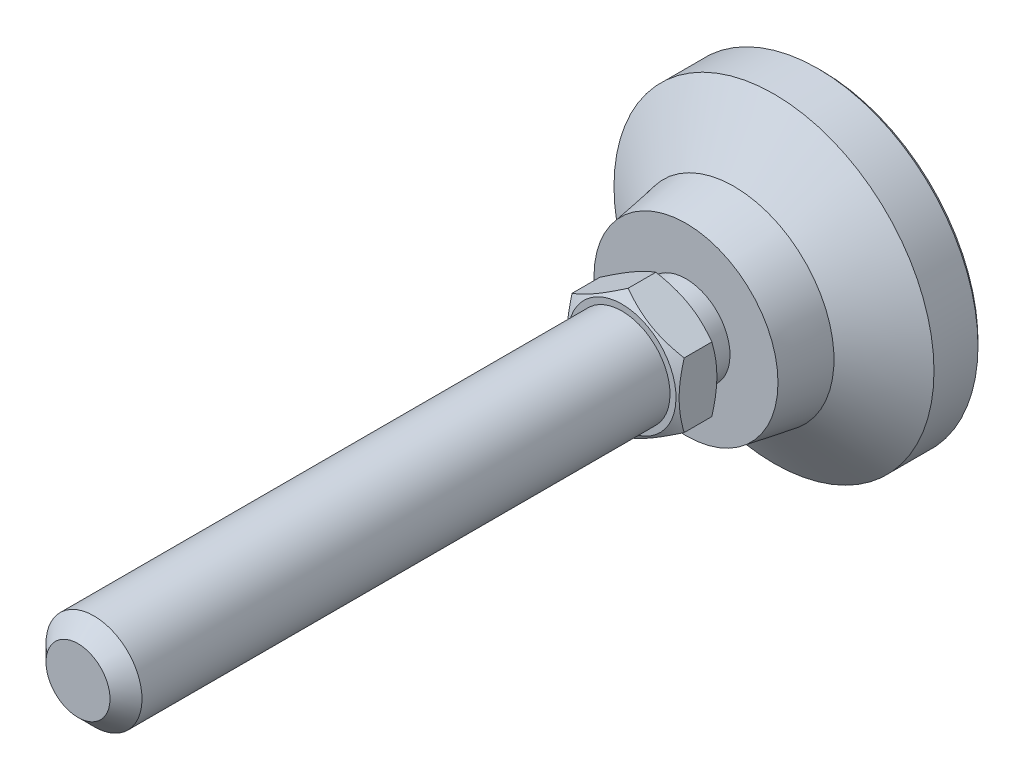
ISO-10303-21;
HEADER;
FILE_DESCRIPTION(('STEP AP214'),'2;1');
FILE_NAME('part.step','',(''),(''),'','','');
FILE_SCHEMA(('AUTOMOTIVE_DESIGN { 1 0 10303 214 1 1 1 1 }'));
ENDSEC;
DATA;
#1=APPLICATION_CONTEXT('core data for automotive mechanical design processes');
#2=APPLICATION_PROTOCOL_DEFINITION('international standard','automotive_design',2000,#1);
#3=PRODUCT_CONTEXT('',#1,'mechanical');
#4=PRODUCT('Part','Part','',(#3));
#5=PRODUCT_RELATED_PRODUCT_CATEGORY('part','',(#4));
#6=PRODUCT_DEFINITION_FORMATION('','',#4);
#7=PRODUCT_DEFINITION_CONTEXT('part definition',#1,'design');
#8=PRODUCT_DEFINITION('design','',#6,#7);
#9=PRODUCT_DEFINITION_SHAPE('','',#8);
#10=(LENGTH_UNIT() NAMED_UNIT(*) SI_UNIT(.MILLI.,.METRE.));
#11=(NAMED_UNIT(*) PLANE_ANGLE_UNIT() SI_UNIT($,.RADIAN.));
#12=(NAMED_UNIT(*) SI_UNIT($,.STERADIAN.) SOLID_ANGLE_UNIT());
#13=UNCERTAINTY_MEASURE_WITH_UNIT(LENGTH_MEASURE(1.E-05),#10,'distance_accuracy_value','');
#14=(GEOMETRIC_REPRESENTATION_CONTEXT(3) GLOBAL_UNCERTAINTY_ASSIGNED_CONTEXT((#13)) GLOBAL_UNIT_ASSIGNED_CONTEXT((#10,
#11,#12)) REPRESENTATION_CONTEXT('',''));
#15=CARTESIAN_POINT('',(0.,0.,0.));
#16=DIRECTION('',(0.,0.,1.));
#17=DIRECTION('',(1.,0.,0.));
#18=AXIS2_PLACEMENT_3D('',#15,#16,#17);
#19=CARTESIAN_POINT('',(-5.49999999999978,0.,20.));
#20=DIRECTION('',(0.,0.,1.));
#21=DIRECTION('',(0.,-1.,0.));
#22=AXIS2_PLACEMENT_3D('',#19,#20,#21);
#23=PLANE('',#22);
#24=CARTESIAN_POINT('',(0.,0.,20.));
#25=DIRECTION('',(0.,0.,-1.));
#26=DIRECTION('',(0.,1.,0.));
#27=AXIS2_PLACEMENT_3D('',#24,#25,#26);
#28=CIRCLE('',#27,5.49999999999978);
#29=CARTESIAN_POINT('',(0.,5.49999999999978,20.));
#30=VERTEX_POINT('',#29);
#31=EDGE_CURVE('E99',#30,#30,#28,.T.);
#32=ORIENTED_EDGE('',*,*,#31,.F.);
#33=EDGE_LOOP('',(#32));
#34=FACE_BOUND('',#33,.T.);
#35=CARTESIAN_POINT('',(0.,0.,20.));
#36=DIRECTION('',(0.,0.,-1.));
#37=DIRECTION('',(0.,1.,0.));
#38=AXIS2_PLACEMENT_3D('',#35,#36,#37);
#39=CIRCLE('',#38,6.75);
#40=CARTESIAN_POINT('',(0.,6.75,20.));
#41=VERTEX_POINT('',#40);
#42=EDGE_CURVE('E79',#41,#41,#39,.T.);
#43=ORIENTED_EDGE('',*,*,#42,.T.);
#44=EDGE_LOOP('',(#43));
#45=FACE_BOUND('',#44,.T.);
#46=ADVANCED_FACE('F14',(#34,#45),#23,.F.);
#47=CARTESIAN_POINT('',(0.,0.,-1.00000000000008));
#48=DIRECTION('',(0.,0.,-1.));
#49=DIRECTION('',(0.,1.,0.));
#50=AXIS2_PLACEMENT_3D('',#47,#48,#49);
#51=CYLINDRICAL_SURFACE('',#50,20.);
#52=CARTESIAN_POINT('',(0.,0.,0.500000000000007));
#53=DIRECTION('',(0.,0.,-1.));
#54=DIRECTION('',(0.,1.,0.));
#55=AXIS2_PLACEMENT_3D('',#52,#53,#54);
#56=CIRCLE('',#55,20.);
#57=CARTESIAN_POINT('',(0.,20.,0.500000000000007));
#58=VERTEX_POINT('',#57);
#59=EDGE_CURVE('E117',#58,#58,#56,.F.);
#60=ORIENTED_EDGE('',*,*,#59,.T.);
#61=EDGE_LOOP('',(#60));
#62=FACE_BOUND('',#61,.T.);
#63=CARTESIAN_POINT('',(0.,0.,6.));
#64=DIRECTION('',(0.,0.,-1.));
#65=DIRECTION('',(0.,1.,0.));
#66=AXIS2_PLACEMENT_3D('',#63,#64,#65);
#67=CIRCLE('',#66,20.);
#68=CARTESIAN_POINT('',(0.,20.,6.));
#69=VERTEX_POINT('',#68);
#70=EDGE_CURVE('E111',#69,#69,#67,.T.);
#71=ORIENTED_EDGE('',*,*,#70,.T.);
#72=EDGE_LOOP('',(#71));
#73=FACE_BOUND('',#72,.T.);
#74=ADVANCED_FACE('F239',(#62,#73),#51,.T.);
#75=CARTESIAN_POINT('',(0.,0.,11.));
#76=DIRECTION('',(0.,0.,-1.));
#77=DIRECTION('',(0.,1.,0.));
#78=AXIS2_PLACEMENT_3D('',#75,#76,#77);
#79=CONICAL_SURFACE('',#78,12.5,0.98279372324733);
#80=ORIENTED_EDGE('',*,*,#70,.F.);
#81=EDGE_LOOP('',(#80));
#82=FACE_BOUND('',#81,.T.);
#83=CARTESIAN_POINT('',(0.,0.,11.));
#84=DIRECTION('',(0.,0.,-1.));
#85=DIRECTION('',(0.,1.,0.));
#86=AXIS2_PLACEMENT_3D('',#83,#84,#85);
#87=CIRCLE('',#86,12.5);
#88=CARTESIAN_POINT('',(0.,12.5,11.));
#89=VERTEX_POINT('',#88);
#90=EDGE_CURVE('E108',#89,#89,#87,.T.);
#91=ORIENTED_EDGE('',*,*,#90,.T.);
#92=EDGE_LOOP('',(#91));
#93=FACE_BOUND('',#92,.T.);
#94=ADVANCED_FACE('F246',(#82,#93),#79,.T.);
#95=CARTESIAN_POINT('',(0.,0.,17.));
#96=DIRECTION('',(0.,0.,-1.));
#97=DIRECTION('',(0.,1.,0.));
#98=AXIS2_PLACEMENT_3D('',#95,#96,#97);
#99=CONICAL_SURFACE('',#98,11.5,0.165148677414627);
#100=ORIENTED_EDGE('',*,*,#90,.F.);
#101=EDGE_LOOP('',(#100));
#102=FACE_BOUND('',#101,.T.);
#103=CARTESIAN_POINT('',(0.,0.,17.));
#104=DIRECTION('',(0.,0.,-1.));
#105=DIRECTION('',(0.,1.,0.));
#106=AXIS2_PLACEMENT_3D('',#103,#104,#105);
#107=CIRCLE('',#106,11.5);
#108=CARTESIAN_POINT('',(0.,11.5,17.));
#109=VERTEX_POINT('',#108);
#110=EDGE_CURVE('E105',#109,#109,#107,.T.);
#111=ORIENTED_EDGE('',*,*,#110,.T.);
#112=EDGE_LOOP('',(#111));
#113=FACE_BOUND('',#112,.T.);
#114=ADVANCED_FACE('F258',(#102,#113),#99,.T.);
#115=CARTESIAN_POINT('',(-11.5,0.,17.));
#116=DIRECTION('',(0.,0.,-1.));
#117=DIRECTION('',(0.,1.,0.));
#118=AXIS2_PLACEMENT_3D('',#115,#116,#117);
#119=PLANE('',#118);
#120=ORIENTED_EDGE('',*,*,#110,.F.);
#121=EDGE_LOOP('',(#120));
#122=FACE_BOUND('',#121,.T.);
#123=CARTESIAN_POINT('',(0.,0.,17.));
#124=DIRECTION('',(0.,0.,-1.));
#125=DIRECTION('',(0.,1.,0.));
#126=AXIS2_PLACEMENT_3D('',#123,#124,#125);
#127=CIRCLE('',#126,5.49999999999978);
#128=CARTESIAN_POINT('',(0.,5.49999999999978,17.));
#129=VERTEX_POINT('',#128);
#130=EDGE_CURVE('E102',#129,#129,#127,.T.);
#131=ORIENTED_EDGE('',*,*,#130,.T.);
#132=EDGE_LOOP('',(#131));
#133=FACE_BOUND('',#132,.T.);
#134=ADVANCED_FACE('F254',(#122,#133),#119,.F.);
#135=CARTESIAN_POINT('',(0.,0.,-1.00000000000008));
#136=DIRECTION('',(0.,0.,-1.));
#137=DIRECTION('',(0.,1.,0.));
#138=AXIS2_PLACEMENT_3D('',#135,#136,#137);
#139=CYLINDRICAL_SURFACE('',#138,5.49999999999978);
#140=ORIENTED_EDGE('',*,*,#130,.F.);
#141=EDGE_LOOP('',(#140));
#142=FACE_BOUND('',#141,.T.);
#143=ORIENTED_EDGE('',*,*,#31,.T.);
#144=EDGE_LOOP('',(#143));
#145=FACE_BOUND('',#144,.T.);
#146=ADVANCED_FACE('F251',(#142,#145),#139,.T.);
#147=CARTESIAN_POINT('',(0.,0.,0.));
#148=DIRECTION('',(0.,0.,-1.));
#149=DIRECTION('',(0.,1.,0.));
#150=AXIS2_PLACEMENT_3D('',#147,#148,#149);
#151=PLANE('',#150);
#152=CARTESIAN_POINT('',(0.,0.,0.));
#153=DIRECTION('',(0.,0.,-1.));
#154=DIRECTION('',(0.,1.,0.));
#155=AXIS2_PLACEMENT_3D('',#152,#153,#154);
#156=CIRCLE('',#155,19.5);
#157=CARTESIAN_POINT('',(0.,19.5,0.));
#158=VERTEX_POINT('',#157);
#159=EDGE_CURVE('E114',#158,#158,#156,.T.);
#160=ORIENTED_EDGE('',*,*,#159,.T.);
#161=EDGE_LOOP('',(#160));
#162=FACE_BOUND('',#161,.T.);
#163=ADVANCED_FACE('F197',(#162),#151,.T.);
#164=CARTESIAN_POINT('',(0.,0.,0.));
#165=DIRECTION('',(0.,0.,1.));
#166=DIRECTION('',(0.,-1.,0.));
#167=AXIS2_PLACEMENT_3D('',#164,#165,#166);
#168=CONICAL_SURFACE('',#167,19.5,0.785398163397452);
#169=ORIENTED_EDGE('',*,*,#59,.F.);
#170=EDGE_LOOP('',(#169));
#171=FACE_BOUND('',#170,.T.);
#172=ORIENTED_EDGE('',*,*,#159,.F.);
#173=EDGE_LOOP('',(#172));
#174=FACE_BOUND('',#173,.T.);
#175=ADVANCED_FACE('F16',(#171,#174),#168,.T.);
#176=CARTESIAN_POINT('',(0.,0.,20.));
#177=DIRECTION('',(0.,0.,1.));
#178=DIRECTION('',(0.,-1.,0.));
#179=AXIS2_PLACEMENT_3D('',#176,#177,#178);
#180=CONICAL_SURFACE('',#179,6.75,1.0471975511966);
#181=CARTESIAN_POINT('',(-7.,10.8488447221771,23.5571335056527));
#182=CARTESIAN_POINT('',(-7.,10.54316649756,23.408880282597));
#183=CARTESIAN_POINT('',(-7.,10.2367858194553,23.2620505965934));
#184=CARTESIAN_POINT('',(-7.,9.62224595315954,22.972039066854));
#185=CARTESIAN_POINT('',(-7.,9.3140864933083,22.828857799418));
#186=CARTESIAN_POINT('',(-7.,8.69402439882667,22.5462220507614));
#187=CARTESIAN_POINT('',(-7.,8.38211051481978,22.4067921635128));
#188=CARTESIAN_POINT('',(-7.,7.75579949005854,22.1336476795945));
#189=CARTESIAN_POINT('',(-7.,7.44140246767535,21.9999328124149));
#190=CARTESIAN_POINT('',(-7.,6.79950510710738,21.7355595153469));
#191=CARTESIAN_POINT('',(-7.,6.47190749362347,21.6051359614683));
#192=CARTESIAN_POINT('',(-7.,5.81287781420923,21.3541766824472));
#193=CARTESIAN_POINT('',(-7.,5.48144532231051,21.2336420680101));
#194=CARTESIAN_POINT('',(-7.,4.81483717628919,21.0056303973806));
#195=CARTESIAN_POINT('',(-7.,4.47967068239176,20.8981268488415));
#196=CARTESIAN_POINT('',(-7.,3.80454198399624,20.6996300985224));
#197=CARTESIAN_POINT('',(-7.,3.46458132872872,20.6086316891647));
#198=CARTESIAN_POINT('',(-7.,2.78149969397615,20.448006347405));
#199=CARTESIAN_POINT('',(-7.,2.43840664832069,20.3782638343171));
#200=CARTESIAN_POINT('',(-7.,1.92064834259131,20.2926149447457));
#201=CARTESIAN_POINT('',(-7.,1.74752969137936,20.2672249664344));
#202=CARTESIAN_POINT('',(-7.,1.40043427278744,20.2232648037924));
#203=CARTESIAN_POINT('',(-7.,1.22645758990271,20.2046939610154));
#204=CARTESIAN_POINT('',(-7.,0.880149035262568,20.1749746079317));
#205=CARTESIAN_POINT('',(-7.,0.707825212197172,20.1637326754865));
#206=CARTESIAN_POINT('',(-7.,0.36285665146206,20.1485455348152));
#207=CARTESIAN_POINT('',(-7.,0.190211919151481,20.1446002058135));
#208=CARTESIAN_POINT('',(-7.,-0.155089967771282,20.1441003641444));
#209=CARTESIAN_POINT('',(-7.,-0.327747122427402,20.147545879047));
#210=CARTESIAN_POINT('',(-7.,-0.672762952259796,20.1617436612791));
#211=CARTESIAN_POINT('',(-7.,-0.845121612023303,20.17249629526));
#212=CARTESIAN_POINT('',(-7.,-1.25956110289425,20.2069092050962));
#213=CARTESIAN_POINT('',(-7.,-1.50135915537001,20.2340480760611));
#214=CARTESIAN_POINT('',(-7.,-1.98314470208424,20.3012244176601));
#215=CARTESIAN_POINT('',(-7.,-2.22313194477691,20.3412636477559));
#216=CARTESIAN_POINT('',(-7.,-2.9401119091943,20.4786074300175));
#217=CARTESIAN_POINT('',(-7.,-3.41385239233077,20.5931126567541));
#218=CARTESIAN_POINT('',(-7.,-4.12221452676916,20.7914787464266));
#219=CARTESIAN_POINT('',(-7.,-4.36051529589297,20.8629554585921));
#220=CARTESIAN_POINT('',(-7.,-4.83480193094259,21.0132839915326));
#221=CARTESIAN_POINT('',(-7.,-5.07078778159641,21.0921358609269));
#222=CARTESIAN_POINT('',(-7.,-5.54051977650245,21.25595358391));
#223=CARTESIAN_POINT('',(-7.,-5.77426664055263,21.340917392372));
#224=CARTESIAN_POINT('',(-7.,-6.23982693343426,21.5159641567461));
#225=CARTESIAN_POINT('',(-7.,-6.47164038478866,21.6060470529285));
#226=CARTESIAN_POINT('',(-7.,-7.0182384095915,21.824296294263));
#227=CARTESIAN_POINT('',(-7.,-7.33228157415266,21.954316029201));
#228=CARTESIAN_POINT('',(-7.,-7.95770289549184,22.2206327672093));
#229=CARTESIAN_POINT('',(-7.,-8.26908088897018,22.3569301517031));
#230=CARTESIAN_POINT('',(-7.,-8.88966173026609,22.634542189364));
#231=CARTESIAN_POINT('',(-7.,-9.19886412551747,22.775857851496));
#232=CARTESIAN_POINT('',(-7.,-9.81540622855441,23.0625028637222));
#233=CARTESIAN_POINT('',(-7.,-10.1227458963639,23.2078322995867));
#234=CARTESIAN_POINT('',(-7.,-10.7361886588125,23.50190577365));
#235=CARTESIAN_POINT('',(-7.,-11.0422900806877,23.6506532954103));
#236=CARTESIAN_POINT('',(-7.,-11.6531748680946,23.9508331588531));
#237=CARTESIAN_POINT('',(-7.,-11.9579582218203,24.1022655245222));
#238=CARTESIAN_POINT('',(-7.,-12.8705649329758,24.5598357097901));
#239=CARTESIAN_POINT('',(-7.,-13.4767270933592,24.8692863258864));
#240=CARTESIAN_POINT('',(-7.,-14.6351492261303,25.4681976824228));
#241=CARTESIAN_POINT('',(-7.,-15.1876682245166,25.7571596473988));
#242=CARTESIAN_POINT('',(-7.,-16.2906541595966,26.3390179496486));
#243=CARTESIAN_POINT('',(-7.,-16.8411210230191,26.6319144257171));
#244=CARTESIAN_POINT('',(-7.,-17.9390847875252,27.2199706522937));
#245=CARTESIAN_POINT('',(-7.,-18.4865856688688,27.5151229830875));
#246=CARTESIAN_POINT('',(-7.,-19.5802752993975,28.107778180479));
#247=CARTESIAN_POINT('',(-7.,-20.126464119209,28.4052809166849));
#248=CARTESIAN_POINT('',(-7.,-20.6721700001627,28.7036609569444));
#249=B_SPLINE_CURVE_WITH_KNOTS('',3,(#181,#182,#183,#184,#185,#186,#187,#188,#189,#190,#191,
#192,#193,#194,#195,#196,#197,#198,#199,#200,#201,#202,#203,#204,#205,#206,#207,#208,#209,#210,
#211,#212,#213,#214,#215,#216,#217,#218,#219,#220,#221,#222,#223,#224,#225,#226,#227,#228,#229,
#230,#231,#232,#233,#234,#235,#236,#237,#238,#239,#240,#241,#242,#243,#244,#245,#246,#247,#248),
.UNSPECIFIED.,.F.,.F.,(4,2,2,2,2,2,2,2,2,2,2,2,2,2,2,2,2,2,2,2,2,2,2,2,2,2,2,2,2,2,2,2,2,4),(0.,
1.01921008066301,2.03858016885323,3.06351163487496,4.08839453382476,5.14608656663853,
6.20389723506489,7.25951994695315,8.31480901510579,9.36425304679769,9.88905173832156,
10.4137997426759,10.9317207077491,11.4496330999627,11.9675474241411,12.4854877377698,
13.2150242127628,13.9446602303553,15.4047436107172,16.151050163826,16.8973616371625,
17.6434245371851,18.389478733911,19.4090700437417,20.4287233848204,21.4485829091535,
22.4684642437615,23.4894356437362,24.510416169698,26.5521035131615,28.4226443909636,
30.2932514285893,32.1592166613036,34.025079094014),.UNSPECIFIED.);
#250=CARTESIAN_POINT('',(-7.,4.04145188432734,20.7695523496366));
#251=VERTEX_POINT('',#250);
#252=CARTESIAN_POINT('',(-7.,-4.04145188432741,20.7695523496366));
#253=VERTEX_POINT('',#252);
#254=EDGE_CURVE('E85',#251,#253,#249,.T.);
#255=ORIENTED_EDGE('',*,*,#254,.F.);
#256=CARTESIAN_POINT('',(0.000200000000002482,8.08301923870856,20.7696190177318));
#257=CARTESIAN_POINT('',(-0.153667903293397,7.99418356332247,20.7183374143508));
#258=CARTESIAN_POINT('',(-0.308109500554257,7.90501666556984,20.669383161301));
#259=CARTESIAN_POINT('',(-0.618246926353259,7.725958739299,20.5767703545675));
#260=CARTESIAN_POINT('',(-0.773943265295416,7.63606741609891,20.5331140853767));
#261=CARTESIAN_POINT('',(-1.24352516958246,7.36495417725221,20.4109491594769));
#262=CARTESIAN_POINT('',(-1.5592643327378,7.18266208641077,20.3414631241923));
#263=CARTESIAN_POINT('',(-2.03176224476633,6.90986528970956,20.2599825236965));
#264=CARTESIAN_POINT('',(-2.18710922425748,6.82017566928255,20.2367710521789));
#265=CARTESIAN_POINT('',(-2.49850511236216,6.64039116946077,20.1978487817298));
#266=CARTESIAN_POINT('',(-2.6545539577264,6.55029632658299,20.1821373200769));
#267=CARTESIAN_POINT('',(-2.96692267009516,6.36995016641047,20.1586154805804));
#268=CARTESIAN_POINT('',(-3.12324202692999,6.27969914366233,20.1507961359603));
#269=CARTESIAN_POINT('',(-3.43601650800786,6.09911871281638,20.1432178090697));
#270=CARTESIAN_POINT('',(-3.59247162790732,6.00878930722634,20.1434585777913));
#271=CARTESIAN_POINT('',(-4.02110687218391,5.76131663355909,20.1551972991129));
#272=CARTESIAN_POINT('',(-4.29314668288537,5.6042543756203,20.1749033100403));
#273=CARTESIAN_POINT('',(-4.83541944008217,5.29117305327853,20.2373910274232));
#274=CARTESIAN_POINT('',(-5.10565047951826,5.13515508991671,20.2801940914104));
#275=CARTESIAN_POINT('',(-5.64901454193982,4.82144370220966,20.3871892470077));
#276=CARTESIAN_POINT('',(-5.92207900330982,4.66378986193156,20.4518346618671));
#277=CARTESIAN_POINT('',(-6.46413578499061,4.35083323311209,20.5985536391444));
#278=CARTESIAN_POINT('',(-6.73313504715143,4.19552643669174,20.6805927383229));
#279=CARTESIAN_POINT('',(-7.0002,4.0413364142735,20.7696190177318));
#280=B_SPLINE_CURVE_WITH_KNOTS('',3,(#256,#257,#258,#259,#260,#261,#262,#263,#264,#265,#266,
#267,#268,#269,#270,#271,#272,#273,#274,#275,#276,#277,#278,#279),.UNSPECIFIED.,.F.,.F.,(4,2,2,
2,2,2,2,2,2,2,2,4),(0.,0.554727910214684,1.10969417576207,2.22193274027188,2.76443041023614,
3.30688013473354,3.84871284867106,4.39052882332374,5.33376515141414,6.27787517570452,
7.24292418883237,8.20607866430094),.UNSPECIFIED.);
#281=CARTESIAN_POINT('',(0.,8.08290376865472,20.7695523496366));
#282=VERTEX_POINT('',#281);
#283=EDGE_CURVE('E206',#282,#251,#280,.T.);
#284=ORIENTED_EDGE('',*,*,#283,.F.);
#285=CARTESIAN_POINT('',(7.0002,4.04133641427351,20.7696190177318));
#286=CARTESIAN_POINT('',(6.8463320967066,4.1301720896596,20.7183374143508));
#287=CARTESIAN_POINT('',(6.69189049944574,4.21933898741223,20.669383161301));
#288=CARTESIAN_POINT('',(6.38175307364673,4.39839691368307,20.5767703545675));
#289=CARTESIAN_POINT('',(6.22605673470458,4.48828823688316,20.5331140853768));
#290=CARTESIAN_POINT('',(5.75647483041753,4.75940147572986,20.4109491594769));
#291=CARTESIAN_POINT('',(5.44073566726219,4.9416935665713,20.3414631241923));
#292=CARTESIAN_POINT('',(4.96823775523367,5.21449036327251,20.2599825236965));
#293=CARTESIAN_POINT('',(4.81289077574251,5.30417998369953,20.2367710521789));
#294=CARTESIAN_POINT('',(4.50149488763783,5.4839644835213,20.1978487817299));
#295=CARTESIAN_POINT('',(4.34544604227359,5.57405932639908,20.1821373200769));
#296=CARTESIAN_POINT('',(4.03307732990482,5.7544054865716,20.1586154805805));
#297=CARTESIAN_POINT('',(3.87675797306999,5.84465650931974,20.1507961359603));
#298=CARTESIAN_POINT('',(3.56398349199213,6.02523694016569,20.1432178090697));
#299=CARTESIAN_POINT('',(3.40752837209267,6.11556634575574,20.1434585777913));
#300=CARTESIAN_POINT('',(2.97889312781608,6.36303901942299,20.1551972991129));
#301=CARTESIAN_POINT('',(2.70685331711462,6.52010127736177,20.1749033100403));
#302=CARTESIAN_POINT('',(2.16458055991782,6.83318259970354,20.2373910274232));
#303=CARTESIAN_POINT('',(1.89434952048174,6.98920056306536,20.2801940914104));
#304=CARTESIAN_POINT('',(1.35098545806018,7.30291195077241,20.3871892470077));
#305=CARTESIAN_POINT('',(1.07792099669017,7.46056579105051,20.4518346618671));
#306=CARTESIAN_POINT('',(0.535864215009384,7.77352241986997,20.5985536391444));
#307=CARTESIAN_POINT('',(0.26686495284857,7.92882921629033,20.6805927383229));
#308=CARTESIAN_POINT('',(-0.000199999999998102,8.08301923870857,20.7696190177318));
#309=B_SPLINE_CURVE_WITH_KNOTS('',3,(#285,#286,#287,#288,#289,#290,#291,#292,#293,#294,#295,
#296,#297,#298,#299,#300,#301,#302,#303,#304,#305,#306,#307,#308),.UNSPECIFIED.,.F.,.F.,(4,2,2,
2,2,2,2,2,2,2,2,4),(0.,0.554727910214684,1.10969417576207,2.22193274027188,2.76443041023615,
3.30688013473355,3.84871284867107,4.39052882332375,5.33376515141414,6.27787517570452,
7.24292418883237,8.20607866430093),.UNSPECIFIED.);
#310=CARTESIAN_POINT('',(7.,4.04145188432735,20.7695523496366));
#311=VERTEX_POINT('',#310);
#312=EDGE_CURVE('E213',#311,#282,#309,.T.);
#313=ORIENTED_EDGE('',*,*,#312,.F.);
#314=CARTESIAN_POINT('',(7.,10.8488447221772,23.5571335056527));
#315=CARTESIAN_POINT('',(7.,10.5431664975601,23.408880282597));
#316=CARTESIAN_POINT('',(7.,10.2367858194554,23.2620505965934));
#317=CARTESIAN_POINT('',(7.,9.62224595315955,22.972039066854));
#318=CARTESIAN_POINT('',(7.,9.31408649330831,22.828857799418));
#319=CARTESIAN_POINT('',(7.,8.69402439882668,22.5462220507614));
#320=CARTESIAN_POINT('',(7.,8.38211051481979,22.4067921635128));
#321=CARTESIAN_POINT('',(7.,7.75579949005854,22.1336476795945));
#322=CARTESIAN_POINT('',(7.,7.44140246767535,21.9999328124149));
#323=CARTESIAN_POINT('',(7.,6.79950510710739,21.7355595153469));
#324=CARTESIAN_POINT('',(7.,6.47190749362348,21.6051359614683));
#325=CARTESIAN_POINT('',(7.,5.81287781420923,21.3541766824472));
#326=CARTESIAN_POINT('',(7.,5.48144532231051,21.2336420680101));
#327=CARTESIAN_POINT('',(7.,4.81483717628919,21.0056303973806));
#328=CARTESIAN_POINT('',(7.,4.47967068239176,20.8981268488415));
#329=CARTESIAN_POINT('',(7.,3.80454198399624,20.6996300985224));
#330=CARTESIAN_POINT('',(7.,3.46458132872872,20.6086316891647));
#331=CARTESIAN_POINT('',(7.,2.78149969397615,20.448006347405));
#332=CARTESIAN_POINT('',(7.,2.43840664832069,20.3782638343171));
#333=CARTESIAN_POINT('',(7.,1.92064834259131,20.2926149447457));
#334=CARTESIAN_POINT('',(7.,1.74752969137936,20.2672249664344));
#335=CARTESIAN_POINT('',(7.,1.40043427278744,20.2232648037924));
#336=CARTESIAN_POINT('',(7.,1.22645758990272,20.2046939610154));
#337=CARTESIAN_POINT('',(7.,0.880149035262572,20.1749746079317));
#338=CARTESIAN_POINT('',(7.,0.707825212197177,20.1637326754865));
#339=CARTESIAN_POINT('',(7.,0.362856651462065,20.1485455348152));
#340=CARTESIAN_POINT('',(7.,0.190211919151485,20.1446002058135));
#341=CARTESIAN_POINT('',(7.,-0.155089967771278,20.1441003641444));
#342=CARTESIAN_POINT('',(7.,-0.327747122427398,20.147545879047));
#343=CARTESIAN_POINT('',(7.,-0.672762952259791,20.1617436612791));
#344=CARTESIAN_POINT('',(7.,-0.845121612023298,20.17249629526));
#345=CARTESIAN_POINT('',(7.,-1.25956110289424,20.2069092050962));
#346=CARTESIAN_POINT('',(7.,-1.50135915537,20.2340480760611));
#347=CARTESIAN_POINT('',(7.,-1.98314470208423,20.3012244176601));
#348=CARTESIAN_POINT('',(7.,-2.2231319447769,20.3412636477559));
#349=CARTESIAN_POINT('',(7.,-2.94011190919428,20.4786074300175));
#350=CARTESIAN_POINT('',(7.,-3.41385239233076,20.5931126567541));
#351=CARTESIAN_POINT('',(7.,-4.12221452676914,20.7914787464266));
#352=CARTESIAN_POINT('',(7.,-4.36051529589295,20.8629554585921));
#353=CARTESIAN_POINT('',(7.,-4.83480193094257,21.0132839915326));
#354=CARTESIAN_POINT('',(7.,-5.07078778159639,21.0921358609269));
#355=CARTESIAN_POINT('',(7.,-5.54051977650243,21.25595358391));
#356=CARTESIAN_POINT('',(7.,-5.7742666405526,21.340917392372));
#357=CARTESIAN_POINT('',(7.,-6.23982693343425,21.5159641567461));
#358=CARTESIAN_POINT('',(7.,-6.47164038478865,21.6060470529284));
#359=CARTESIAN_POINT('',(7.,-7.01823840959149,21.8242962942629));
#360=CARTESIAN_POINT('',(7.,-7.33228157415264,21.954316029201));
#361=CARTESIAN_POINT('',(7.,-7.95770289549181,22.2206327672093));
#362=CARTESIAN_POINT('',(7.,-8.26908088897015,22.3569301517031));
#363=CARTESIAN_POINT('',(7.,-8.88966173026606,22.634542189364));
#364=CARTESIAN_POINT('',(7.,-9.19886412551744,22.775857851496));
#365=CARTESIAN_POINT('',(7.,-9.81540622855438,23.0625028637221));
#366=CARTESIAN_POINT('',(7.,-10.1227458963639,23.2078322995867));
#367=CARTESIAN_POINT('',(7.,-10.7361886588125,23.50190577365));
#368=CARTESIAN_POINT('',(7.,-11.0422900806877,23.6506532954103));
#369=CARTESIAN_POINT('',(7.,-11.6531748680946,23.9508331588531));
#370=CARTESIAN_POINT('',(7.,-11.9579582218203,24.1022655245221));
#371=CARTESIAN_POINT('',(7.,-12.8705649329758,24.5598357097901));
#372=CARTESIAN_POINT('',(7.,-13.4767270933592,24.8692863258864));
#373=CARTESIAN_POINT('',(7.,-14.6351492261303,25.4681976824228));
#374=CARTESIAN_POINT('',(7.,-15.1876682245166,25.7571596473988));
#375=CARTESIAN_POINT('',(7.,-16.2906541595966,26.3390179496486));
#376=CARTESIAN_POINT('',(7.,-16.8411210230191,26.6319144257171));
#377=CARTESIAN_POINT('',(7.,-17.9390847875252,27.2199706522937));
#378=CARTESIAN_POINT('',(7.,-18.4865856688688,27.5151229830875));
#379=CARTESIAN_POINT('',(7.,-19.5802752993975,28.107778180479));
#380=CARTESIAN_POINT('',(7.,-20.126464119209,28.4052809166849));
#381=CARTESIAN_POINT('',(7.,-20.6721700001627,28.7036609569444));
#382=B_SPLINE_CURVE_WITH_KNOTS('',3,(#314,#315,#316,#317,#318,#319,#320,#321,#322,#323,#324,
#325,#326,#327,#328,#329,#330,#331,#332,#333,#334,#335,#336,#337,#338,#339,#340,#341,#342,#343,
#344,#345,#346,#347,#348,#349,#350,#351,#352,#353,#354,#355,#356,#357,#358,#359,#360,#361,#362,
#363,#364,#365,#366,#367,#368,#369,#370,#371,#372,#373,#374,#375,#376,#377,#378,#379,#380,#381),
.UNSPECIFIED.,.F.,.F.,(4,2,2,2,2,2,2,2,2,2,2,2,2,2,2,2,2,2,2,2,2,2,2,2,2,2,2,2,2,2,2,2,2,4),(0.,
1.01921008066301,2.03858016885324,3.06351163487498,4.08839453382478,5.14608656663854,
6.20389723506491,7.25951994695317,8.31480901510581,9.3642530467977,9.88905173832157,
10.4137997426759,10.9317207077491,11.4496330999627,11.9675474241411,12.4854877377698,
13.2150242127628,13.9446602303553,15.4047436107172,16.151050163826,16.8973616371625,
17.6434245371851,18.389478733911,19.4090700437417,20.4287233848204,21.4485829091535,
22.4684642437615,23.4894356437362,24.510416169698,26.5521035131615,28.4226443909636,
30.2932514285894,32.1592166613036,34.0250790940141),.UNSPECIFIED.);
#383=CARTESIAN_POINT('',(7.,-4.04145188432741,20.7695523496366));
#384=VERTEX_POINT('',#383);
#385=EDGE_CURVE('E35',#384,#311,#382,.F.);
#386=ORIENTED_EDGE('',*,*,#385,.F.);
#387=CARTESIAN_POINT('',(-0.000199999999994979,-8.08301923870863,20.7696190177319));
#388=CARTESIAN_POINT('',(0.153667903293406,-7.99418356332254,20.7183374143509));
#389=CARTESIAN_POINT('',(0.308109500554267,-7.90501666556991,20.669383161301));
#390=CARTESIAN_POINT('',(0.618246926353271,-7.72595873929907,20.5767703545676));
#391=CARTESIAN_POINT('',(0.77394326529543,-7.63606741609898,20.5331140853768));
#392=CARTESIAN_POINT('',(1.24352516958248,-7.36495417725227,20.4109491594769));
#393=CARTESIAN_POINT('',(1.55926433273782,-7.18266208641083,20.3414631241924));
#394=CARTESIAN_POINT('',(2.03176224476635,-6.90986528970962,20.2599825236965));
#395=CARTESIAN_POINT('',(2.18710922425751,-6.82017566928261,20.2367710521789));
#396=CARTESIAN_POINT('',(2.49850511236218,-6.64039116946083,20.1978487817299));
#397=CARTESIAN_POINT('',(2.65455395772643,-6.55029632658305,20.1821373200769));
#398=CARTESIAN_POINT('',(2.9669226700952,-6.36995016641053,20.1586154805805));
#399=CARTESIAN_POINT('',(3.12324202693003,-6.27969914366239,20.1507961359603));
#400=CARTESIAN_POINT('',(3.43601650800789,-6.09911871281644,20.1432178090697));
#401=CARTESIAN_POINT('',(3.59247162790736,-6.00878930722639,20.1434585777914));
#402=CARTESIAN_POINT('',(4.02110687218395,-5.76131663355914,20.1551972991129));
#403=CARTESIAN_POINT('',(4.29314668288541,-5.60425437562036,20.1749033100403));
#404=CARTESIAN_POINT('',(4.8354194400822,-5.29117305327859,20.2373910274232));
#405=CARTESIAN_POINT('',(5.10565047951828,-5.13515508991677,20.2801940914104));
#406=CARTESIAN_POINT('',(5.64901454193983,-4.82144370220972,20.3871892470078));
#407=CARTESIAN_POINT('',(5.92207900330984,-4.66378986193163,20.4518346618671));
#408=CARTESIAN_POINT('',(6.46413578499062,-4.35083323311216,20.5985536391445));
#409=CARTESIAN_POINT('',(6.73313504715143,-4.19552643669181,20.680592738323));
#410=CARTESIAN_POINT('',(7.0002,-4.04133641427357,20.7696190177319));
#411=B_SPLINE_CURVE_WITH_KNOTS('',3,(#387,#388,#389,#390,#391,#392,#393,#394,#395,#396,#397,
#398,#399,#400,#401,#402,#403,#404,#405,#406,#407,#408,#409,#410),.UNSPECIFIED.,.F.,.F.,(4,2,2,
2,2,2,2,2,2,2,2,4),(0.,0.554727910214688,1.10969417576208,2.2219327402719,2.76443041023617,
3.30688013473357,3.8487128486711,4.39052882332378,5.33376515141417,6.27787517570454,
7.24292418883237,8.20607866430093),.UNSPECIFIED.);
#412=CARTESIAN_POINT('',(0.,-8.08290376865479,20.7695523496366));
#413=VERTEX_POINT('',#412);
#414=EDGE_CURVE('E72',#413,#384,#411,.T.);
#415=ORIENTED_EDGE('',*,*,#414,.F.);
#416=CARTESIAN_POINT('',(-7.0002,-4.04133641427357,20.7696190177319));
#417=CARTESIAN_POINT('',(-6.8463320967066,-4.13017208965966,20.7183374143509));
#418=CARTESIAN_POINT('',(-6.69189049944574,-4.21933898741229,20.669383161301));
#419=CARTESIAN_POINT('',(-6.38175307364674,-4.39839691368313,20.5767703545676));
#420=CARTESIAN_POINT('',(-6.22605673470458,-4.48828823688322,20.5331140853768));
#421=CARTESIAN_POINT('',(-5.75647483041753,-4.75940147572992,20.4109491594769));
#422=CARTESIAN_POINT('',(-5.44073566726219,-4.94169356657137,20.3414631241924));
#423=CARTESIAN_POINT('',(-4.96823775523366,-5.21449036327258,20.2599825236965));
#424=CARTESIAN_POINT('',(-4.8128907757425,-5.30417998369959,20.2367710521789));
#425=CARTESIAN_POINT('',(-4.50149488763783,-5.48396448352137,20.1978487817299));
#426=CARTESIAN_POINT('',(-4.34544604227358,-5.57405932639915,20.1821373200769));
#427=CARTESIAN_POINT('',(-4.03307732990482,-5.75440548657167,20.1586154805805));
#428=CARTESIAN_POINT('',(-3.87675797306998,-5.84465650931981,20.1507961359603));
#429=CARTESIAN_POINT('',(-3.56398349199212,-6.02523694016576,20.1432178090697));
#430=CARTESIAN_POINT('',(-3.40752837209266,-6.11556634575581,20.1434585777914));
#431=CARTESIAN_POINT('',(-2.97889312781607,-6.36303901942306,20.1551972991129));
#432=CARTESIAN_POINT('',(-2.7068533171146,-6.52010127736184,20.1749033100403));
#433=CARTESIAN_POINT('',(-2.16458055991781,-6.83318259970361,20.2373910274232));
#434=CARTESIAN_POINT('',(-1.89434952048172,-6.98920056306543,20.2801940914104));
#435=CARTESIAN_POINT('',(-1.35098545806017,-7.30291195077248,20.3871892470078));
#436=CARTESIAN_POINT('',(-1.07792099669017,-7.46056579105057,20.4518346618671));
#437=CARTESIAN_POINT('',(-0.535864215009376,-7.77352241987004,20.5985536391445));
#438=CARTESIAN_POINT('',(-0.266864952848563,-7.92882921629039,20.680592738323));
#439=CARTESIAN_POINT('',(0.000200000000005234,-8.08301923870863,20.7696190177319));
#440=B_SPLINE_CURVE_WITH_KNOTS('',3,(#416,#417,#418,#419,#420,#421,#422,#423,#424,#425,#426,
#427,#428,#429,#430,#431,#432,#433,#434,#435,#436,#437,#438,#439),.UNSPECIFIED.,.F.,.F.,(4,2,2,
2,2,2,2,2,2,2,2,4),(0.,0.554727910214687,1.10969417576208,2.22193274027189,2.76443041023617,
3.30688013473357,3.84871284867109,4.39052882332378,5.33376515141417,6.27787517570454,
7.24292418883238,8.20607866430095),.UNSPECIFIED.);
#441=EDGE_CURVE('E75',#253,#413,#440,.T.);
#442=ORIENTED_EDGE('',*,*,#441,.F.);
#443=EDGE_LOOP('',(#255,#284,#313,#386,#415,#442));
#444=FACE_BOUND('',#443,.T.);
#445=ORIENTED_EDGE('',*,*,#42,.F.);
#446=EDGE_LOOP('',(#445));
#447=FACE_BOUND('',#446,.T.);
#448=ADVANCED_FACE('F73',(#444,#447),#180,.T.);
#449=CARTESIAN_POINT('',(0.,0.,93.));
#450=DIRECTION('',(0.,0.,-1.));
#451=DIRECTION('',(0.,1.,0.));
#452=AXIS2_PLACEMENT_3D('',#449,#450,#451);
#453=PLANE('',#452);
#454=CARTESIAN_POINT('',(0.,0.,93.));
#455=DIRECTION('',(0.,0.,-1.));
#456=DIRECTION('',(0.,1.,0.));
#457=AXIS2_PLACEMENT_3D('',#454,#455,#456);
#458=CIRCLE('',#457,4.);
#459=CARTESIAN_POINT('',(0.,4.,93.));
#460=VERTEX_POINT('',#459);
#461=EDGE_CURVE('E90',#460,#460,#458,.T.);
#462=ORIENTED_EDGE('',*,*,#461,.F.);
#463=EDGE_LOOP('',(#462));
#464=FACE_BOUND('',#463,.T.);
#465=ADVANCED_FACE('F319',(#464),#453,.F.);
#466=CARTESIAN_POINT('',(0.,0.,93.));
#467=DIRECTION('',(0.,0.,-1.));
#468=DIRECTION('',(0.,1.,0.));
#469=AXIS2_PLACEMENT_3D('',#466,#467,#468);
#470=CONICAL_SURFACE('',#469,4.,0.785398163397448);
#471=CARTESIAN_POINT('',(0.,0.,91.));
#472=DIRECTION('',(0.,0.,-1.));
#473=DIRECTION('',(0.,1.,0.));
#474=AXIS2_PLACEMENT_3D('',#471,#472,#473);
#475=CIRCLE('',#474,6.);
#476=CARTESIAN_POINT('',(0.,6.,91.));
#477=VERTEX_POINT('',#476);
#478=EDGE_CURVE('E95',#477,#477,#475,.T.);
#479=ORIENTED_EDGE('',*,*,#478,.F.);
#480=EDGE_LOOP('',(#479));
#481=FACE_BOUND('',#480,.T.);
#482=ORIENTED_EDGE('',*,*,#461,.T.);
#483=EDGE_LOOP('',(#482));
#484=FACE_BOUND('',#483,.T.);
#485=ADVANCED_FACE('F326',(#481,#484),#470,.T.);
#486=CARTESIAN_POINT('',(0.,0.,-7.74975615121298));
#487=DIRECTION('',(0.,0.,-1.));
#488=DIRECTION('',(0.,1.,0.));
#489=AXIS2_PLACEMENT_3D('',#486,#487,#488);
#490=CYLINDRICAL_SURFACE('',#489,6.);
#491=CARTESIAN_POINT('',(0.,0.,25.));
#492=DIRECTION('',(0.,0.,-1.));
#493=DIRECTION('',(0.,1.,0.));
#494=AXIS2_PLACEMENT_3D('',#491,#492,#493);
#495=CIRCLE('',#494,6.);
#496=CARTESIAN_POINT('',(0.,6.,25.));
#497=VERTEX_POINT('',#496);
#498=EDGE_CURVE('E28',#497,#497,#495,.F.);
#499=ORIENTED_EDGE('',*,*,#498,.T.);
#500=EDGE_LOOP('',(#499));
#501=FACE_BOUND('',#500,.T.);
#502=ORIENTED_EDGE('',*,*,#478,.T.);
#503=EDGE_LOOP('',(#502));
#504=FACE_BOUND('',#503,.T.);
#505=ADVANCED_FACE('F122',(#501,#504),#490,.T.);
#506=CARTESIAN_POINT('',(-3.99999999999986,0.,25.));
#507=DIRECTION('',(0.,0.,-1.));
#508=DIRECTION('',(0.,1.,0.));
#509=AXIS2_PLACEMENT_3D('',#506,#507,#508);
#510=PLANE('',#509);
#511=ORIENTED_EDGE('',*,*,#498,.F.);
#512=EDGE_LOOP('',(#511));
#513=FACE_BOUND('',#512,.T.);
#514=CARTESIAN_POINT('',(0.,0.,25.));
#515=DIRECTION('',(0.,0.,-1.));
#516=DIRECTION('',(0.,1.,0.));
#517=AXIS2_PLACEMENT_3D('',#514,#515,#516);
#518=CIRCLE('',#517,6.75);
#519=CARTESIAN_POINT('',(0.,6.75,25.));
#520=VERTEX_POINT('',#519);
#521=EDGE_CURVE('E84',#520,#520,#518,.T.);
#522=ORIENTED_EDGE('',*,*,#521,.F.);
#523=EDGE_LOOP('',(#522));
#524=FACE_BOUND('',#523,.T.);
#525=ADVANCED_FACE('F125',(#513,#524),#510,.F.);
#526=CARTESIAN_POINT('',(0.,0.,23.150480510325));
#527=DIRECTION('',(0.,0.,-1.));
#528=DIRECTION('',(0.,1.,0.));
#529=AXIS2_PLACEMENT_3D('',#526,#527,#528);
#530=CONICAL_SURFACE('',#529,9.95346172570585,1.0471975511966);
#531=CARTESIAN_POINT('',(7.0002,-4.04133641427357,24.230380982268));
#532=CARTESIAN_POINT('',(6.84633209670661,-4.13017208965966,24.281662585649));
#533=CARTESIAN_POINT('',(6.69189049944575,-4.21933898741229,24.3306168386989));
#534=CARTESIAN_POINT('',(6.38175307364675,-4.39839691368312,24.4232296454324));
#535=CARTESIAN_POINT('',(6.22605673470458,-4.48828823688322,24.4668859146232));
#536=CARTESIAN_POINT('',(5.75647483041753,-4.75940147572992,24.589050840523));
#537=CARTESIAN_POINT('',(5.4407356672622,-4.94169356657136,24.6585368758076));
#538=CARTESIAN_POINT('',(4.96823775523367,-5.21449036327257,24.7400174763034));
#539=CARTESIAN_POINT('',(4.81289077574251,-5.30417998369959,24.763228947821));
#540=CARTESIAN_POINT('',(4.50149488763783,-5.48396448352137,24.80215121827));
#541=CARTESIAN_POINT('',(4.34544604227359,-5.57405932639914,24.817862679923));
#542=CARTESIAN_POINT('',(4.03307732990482,-5.75440548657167,24.8413845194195));
#543=CARTESIAN_POINT('',(3.87675797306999,-5.84465650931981,24.8492038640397));
#544=CARTESIAN_POINT('',(3.56398349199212,-6.02523694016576,24.8567821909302));
#545=CARTESIAN_POINT('',(3.40752837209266,-6.11556634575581,24.8565414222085));
#546=CARTESIAN_POINT('',(2.97889312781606,-6.36303901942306,24.8448027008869));
#547=CARTESIAN_POINT('',(2.70685331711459,-6.52010127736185,24.8250966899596));
#548=CARTESIAN_POINT('',(2.1645805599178,-6.83318259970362,24.7626089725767));
#549=CARTESIAN_POINT('',(1.89434952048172,-6.98920056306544,24.7198059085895));
#550=CARTESIAN_POINT('',(1.35098545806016,-7.30291195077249,24.6128107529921));
#551=CARTESIAN_POINT('',(1.07792099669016,-7.46056579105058,24.5481653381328));
#552=CARTESIAN_POINT('',(0.535864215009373,-7.77352241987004,24.4014463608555));
#553=CARTESIAN_POINT('',(0.266864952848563,-7.9288292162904,24.3194072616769));
#554=CARTESIAN_POINT('',(-0.000199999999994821,-8.08301923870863,24.230380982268));
#555=B_SPLINE_CURVE_WITH_KNOTS('',3,(#531,#532,#533,#534,#535,#536,#537,#538,#539,#540,#541,
#542,#543,#544,#545,#546,#547,#548,#549,#550,#551,#552,#553,#554),.UNSPECIFIED.,.F.,.F.,(4,2,2,
2,2,2,2,2,2,2,2,4),(0.,0.554727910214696,1.10969417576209,2.2219327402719,2.76443041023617,
3.30688013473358,3.84871284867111,4.3905288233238,5.33376515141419,6.27787517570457,
7.2429241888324,8.20607866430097),.UNSPECIFIED.);
#556=CARTESIAN_POINT('',(7.,-4.04145188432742,24.2304476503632));
#557=VERTEX_POINT('',#556);
#558=CARTESIAN_POINT('',(0.,-8.08290376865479,24.2304476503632));
#559=VERTEX_POINT('',#558);
#560=EDGE_CURVE('E9',#557,#559,#555,.T.);
#561=ORIENTED_EDGE('',*,*,#560,.F.);
#562=CARTESIAN_POINT('',(7.,10.8488447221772,21.4428664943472));
#563=CARTESIAN_POINT('',(7.,10.5431664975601,21.5911197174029));
#564=CARTESIAN_POINT('',(7.,10.2367858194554,21.7379494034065));
#565=CARTESIAN_POINT('',(7.,9.62224595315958,22.0279609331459));
#566=CARTESIAN_POINT('',(7.,9.31408649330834,22.1711422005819));
#567=CARTESIAN_POINT('',(7.,8.6940243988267,22.4537779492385));
#568=CARTESIAN_POINT('',(7.,8.38211051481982,22.5932078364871));
#569=CARTESIAN_POINT('',(7.,7.75579949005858,22.8663523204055));
#570=CARTESIAN_POINT('',(7.,7.44140246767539,23.000067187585));
#571=CARTESIAN_POINT('',(7.,6.79950510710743,23.264440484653));
#572=CARTESIAN_POINT('',(7.,6.47190749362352,23.3948640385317));
#573=CARTESIAN_POINT('',(7.,5.81287781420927,23.6458233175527));
#574=CARTESIAN_POINT('',(7.,5.48144532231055,23.7663579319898));
#575=CARTESIAN_POINT('',(7.,4.81483717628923,23.9943696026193));
#576=CARTESIAN_POINT('',(7.,4.47967068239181,24.1018731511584));
#577=CARTESIAN_POINT('',(7.,3.80454198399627,24.3003699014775));
#578=CARTESIAN_POINT('',(7.,3.46458132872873,24.3913683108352));
#579=CARTESIAN_POINT('',(7.,2.78149969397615,24.5519936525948));
#580=CARTESIAN_POINT('',(7.,2.4384066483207,24.6217361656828));
#581=CARTESIAN_POINT('',(7.,1.92064834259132,24.7073850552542));
#582=CARTESIAN_POINT('',(7.,1.74752969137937,24.7327750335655));
#583=CARTESIAN_POINT('',(7.,1.40043427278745,24.7767351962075));
#584=CARTESIAN_POINT('',(7.,1.22645758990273,24.7953060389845));
#585=CARTESIAN_POINT('',(7.,0.880149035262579,24.8250253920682));
#586=CARTESIAN_POINT('',(7.,0.707825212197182,24.8362673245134));
#587=CARTESIAN_POINT('',(7.,0.362856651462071,24.8514544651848));
#588=CARTESIAN_POINT('',(7.,0.190211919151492,24.8553997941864));
#589=CARTESIAN_POINT('',(7.,-0.155089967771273,24.8558996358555));
#590=CARTESIAN_POINT('',(7.,-0.327747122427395,24.8524541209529));
#591=CARTESIAN_POINT('',(7.,-0.672762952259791,24.8382563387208));
#592=CARTESIAN_POINT('',(7.,-0.845121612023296,24.8275037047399));
#593=CARTESIAN_POINT('',(7.,-1.25956110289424,24.7930907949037));
#594=CARTESIAN_POINT('',(7.,-1.50135915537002,24.7659519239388));
#595=CARTESIAN_POINT('',(7.,-1.98314470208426,24.6987755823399));
#596=CARTESIAN_POINT('',(7.,-2.22313194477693,24.6587363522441));
#597=CARTESIAN_POINT('',(7.,-2.94011190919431,24.5213925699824));
#598=CARTESIAN_POINT('',(7.,-3.41385239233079,24.4068873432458));
#599=CARTESIAN_POINT('',(7.,-4.12221452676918,24.2085212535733));
#600=CARTESIAN_POINT('',(7.,-4.36051529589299,24.1370445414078));
#601=CARTESIAN_POINT('',(7.,-4.83480193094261,23.9867160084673));
#602=CARTESIAN_POINT('',(7.,-5.07078778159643,23.9078641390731));
#603=CARTESIAN_POINT('',(7.,-5.54051977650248,23.7440464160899));
#604=CARTESIAN_POINT('',(7.,-5.77426664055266,23.6590826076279));
#605=CARTESIAN_POINT('',(7.,-6.23982693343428,23.4840358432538));
#606=CARTESIAN_POINT('',(7.,-6.47164038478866,23.3939529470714));
#607=CARTESIAN_POINT('',(7.,-7.0182384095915,23.1757037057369));
#608=CARTESIAN_POINT('',(7.,-7.33228157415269,23.0456839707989));
#609=CARTESIAN_POINT('',(7.,-7.95770289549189,22.7793672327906));
#610=CARTESIAN_POINT('',(7.,-8.26908088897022,22.6430698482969));
#611=CARTESIAN_POINT('',(7.,-8.88966173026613,22.3654578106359));
#612=CARTESIAN_POINT('',(7.,-9.19886412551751,22.2241421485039));
#613=CARTESIAN_POINT('',(7.,-9.81540622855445,21.9374971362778));
#614=CARTESIAN_POINT('',(7.,-10.122745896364,21.7921677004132));
#615=CARTESIAN_POINT('',(7.,-10.7361886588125,21.4980942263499));
#616=CARTESIAN_POINT('',(7.,-11.0422900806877,21.3493467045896));
#617=CARTESIAN_POINT('',(7.,-11.6531748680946,21.0491668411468));
#618=CARTESIAN_POINT('',(7.,-11.9579582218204,20.8977344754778));
#619=CARTESIAN_POINT('',(7.,-12.8705649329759,20.4401642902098));
#620=CARTESIAN_POINT('',(7.,-13.4767270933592,20.1307136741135));
#621=CARTESIAN_POINT('',(7.,-14.6351492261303,19.5318023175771));
#622=CARTESIAN_POINT('',(7.,-15.1876682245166,19.2428403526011));
#623=CARTESIAN_POINT('',(7.,-16.2906541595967,18.6609820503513));
#624=CARTESIAN_POINT('',(7.,-16.8411210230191,18.3680855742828));
#625=CARTESIAN_POINT('',(7.,-17.9390847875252,17.7800293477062));
#626=CARTESIAN_POINT('',(7.,-18.4865856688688,17.4848770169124));
#627=CARTESIAN_POINT('',(7.,-19.5802752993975,16.8922218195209));
#628=CARTESIAN_POINT('',(7.,-20.126464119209,16.594719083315));
#629=CARTESIAN_POINT('',(7.,-20.6721700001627,16.2963390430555));
#630=B_SPLINE_CURVE_WITH_KNOTS('',3,(#562,#563,#564,#565,#566,#567,#568,#569,#570,#571,#572,
#573,#574,#575,#576,#577,#578,#579,#580,#581,#582,#583,#584,#585,#586,#587,#588,#589,#590,#591,
#592,#593,#594,#595,#596,#597,#598,#599,#600,#601,#602,#603,#604,#605,#606,#607,#608,#609,#610,
#611,#612,#613,#614,#615,#616,#617,#618,#619,#620,#621,#622,#623,#624,#625,#626,#627,#628,#629),
.UNSPECIFIED.,.F.,.F.,(4,2,2,2,2,2,2,2,2,2,2,2,2,2,2,2,2,2,2,2,2,2,2,2,2,2,2,2,2,2,2,2,2,4),(0.,
1.01921008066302,2.03858016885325,3.06351163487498,4.08839453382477,5.14608656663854,
6.2038972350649,7.25951994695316,8.31480901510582,9.36425304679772,9.88905173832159,
10.4137997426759,10.9317207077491,11.4496330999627,11.9675474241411,12.4854877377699,
13.2150242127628,13.9446602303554,15.4047436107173,16.1510501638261,16.8973616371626,
17.6434245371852,18.3894787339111,19.4090700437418,20.4287233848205,21.4485829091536,
22.4684642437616,23.4894356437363,24.5104161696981,26.5521035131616,28.4226443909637,
30.2932514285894,32.1592166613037,34.0250790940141),.UNSPECIFIED.);
#631=CARTESIAN_POINT('',(7.,4.04145188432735,24.2304476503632));
#632=VERTEX_POINT('',#631);
#633=EDGE_CURVE('E133',#632,#557,#630,.T.);
#634=ORIENTED_EDGE('',*,*,#633,.F.);
#635=CARTESIAN_POINT('',(-0.000199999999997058,8.08301923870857,24.2303809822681));
#636=CARTESIAN_POINT('',(0.153667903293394,7.99418356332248,24.2816625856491));
#637=CARTESIAN_POINT('',(0.308109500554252,7.90501666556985,24.330616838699));
#638=CARTESIAN_POINT('',(0.618246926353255,7.72595873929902,24.4232296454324));
#639=CARTESIAN_POINT('',(0.773943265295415,7.63606741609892,24.4668859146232));
#640=CARTESIAN_POINT('',(1.24352516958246,7.36495417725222,24.5890508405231));
#641=CARTESIAN_POINT('',(1.5592643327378,7.18266208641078,24.6585368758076));
#642=CARTESIAN_POINT('',(2.03176224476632,6.90986528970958,24.7400174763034));
#643=CARTESIAN_POINT('',(2.18710922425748,6.82017566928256,24.7632289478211));
#644=CARTESIAN_POINT('',(2.49850511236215,6.64039116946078,24.8021512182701));
#645=CARTESIAN_POINT('',(2.6545539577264,6.55029632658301,24.817862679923));
#646=CARTESIAN_POINT('',(2.96692267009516,6.36995016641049,24.8413845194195));
#647=CARTESIAN_POINT('',(3.12324202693,6.27969914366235,24.8492038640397));
#648=CARTESIAN_POINT('',(3.43601650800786,6.09911871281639,24.8567821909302));
#649=CARTESIAN_POINT('',(3.59247162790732,6.00878930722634,24.8565414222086));
#650=CARTESIAN_POINT('',(4.02110687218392,5.76131663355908,24.8448027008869));
#651=CARTESIAN_POINT('',(4.29314668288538,5.6042543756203,24.8250966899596));
#652=CARTESIAN_POINT('',(4.83541944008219,5.29117305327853,24.7626089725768));
#653=CARTESIAN_POINT('',(5.10565047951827,5.13515508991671,24.7198059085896));
#654=CARTESIAN_POINT('',(5.64901454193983,4.82144370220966,24.6128107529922));
#655=CARTESIAN_POINT('',(5.92207900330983,4.66378986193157,24.5481653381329));
#656=CARTESIAN_POINT('',(6.46413578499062,4.3508332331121,24.4014463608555));
#657=CARTESIAN_POINT('',(6.73313504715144,4.19552643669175,24.319407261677));
#658=CARTESIAN_POINT('',(7.0002,4.04133641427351,24.2303809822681));
#659=B_SPLINE_CURVE_WITH_KNOTS('',3,(#635,#636,#637,#638,#639,#640,#641,#642,#643,#644,#645,
#646,#647,#648,#649,#650,#651,#652,#653,#654,#655,#656,#657,#658),.UNSPECIFIED.,.F.,.F.,(4,2,2,
2,2,2,2,2,2,2,2,4),(0.,0.554727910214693,1.10969417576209,2.22193274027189,2.76443041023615,
3.30688013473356,3.84871284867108,4.39052882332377,5.33376515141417,6.27787517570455,
7.24292418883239,8.20607866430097),.UNSPECIFIED.);
#660=CARTESIAN_POINT('',(0.,8.08290376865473,24.2304476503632));
#661=VERTEX_POINT('',#660);
#662=EDGE_CURVE('E136',#661,#632,#659,.T.);
#663=ORIENTED_EDGE('',*,*,#662,.F.);
#664=CARTESIAN_POINT('',(-7.0002,4.0413364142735,24.2303809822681));
#665=CARTESIAN_POINT('',(-6.84633209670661,4.13017208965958,24.2816625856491));
#666=CARTESIAN_POINT('',(-6.69189049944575,4.21933898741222,24.330616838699));
#667=CARTESIAN_POINT('',(-6.38175307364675,4.39839691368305,24.4232296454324));
#668=CARTESIAN_POINT('',(-6.22605673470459,4.48828823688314,24.4668859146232));
#669=CARTESIAN_POINT('',(-5.75647483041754,4.75940147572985,24.589050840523));
#670=CARTESIAN_POINT('',(-5.44073566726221,4.94169356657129,24.6585368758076));
#671=CARTESIAN_POINT('',(-4.96823775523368,5.21449036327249,24.7400174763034));
#672=CARTESIAN_POINT('',(-4.81289077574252,5.30417998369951,24.7632289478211));
#673=CARTESIAN_POINT('',(-4.50149488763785,5.48396448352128,24.8021512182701));
#674=CARTESIAN_POINT('',(-4.3454460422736,5.57405932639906,24.817862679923));
#675=CARTESIAN_POINT('',(-4.03307732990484,5.75440548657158,24.8413845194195));
#676=CARTESIAN_POINT('',(-3.87675797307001,5.84465650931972,24.8492038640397));
#677=CARTESIAN_POINT('',(-3.56398349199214,6.02523694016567,24.8567821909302));
#678=CARTESIAN_POINT('',(-3.40752837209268,6.11556634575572,24.8565414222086));
#679=CARTESIAN_POINT('',(-2.97889312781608,6.36303901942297,24.8448027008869));
#680=CARTESIAN_POINT('',(-2.70685331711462,6.52010127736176,24.8250966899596));
#681=CARTESIAN_POINT('',(-2.16458055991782,6.83318259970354,24.7626089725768));
#682=CARTESIAN_POINT('',(-1.89434952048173,6.98920056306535,24.7198059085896));
#683=CARTESIAN_POINT('',(-1.35098545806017,7.30291195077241,24.6128107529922));
#684=CARTESIAN_POINT('',(-1.07792099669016,7.4605657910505,24.5481653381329));
#685=CARTESIAN_POINT('',(-0.535864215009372,7.77352241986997,24.4014463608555));
#686=CARTESIAN_POINT('',(-0.26686495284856,7.92882921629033,24.319407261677));
#687=CARTESIAN_POINT('',(0.000200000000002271,8.08301923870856,24.2303809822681));
#688=B_SPLINE_CURVE_WITH_KNOTS('',3,(#664,#665,#666,#667,#668,#669,#670,#671,#672,#673,#674,
#675,#676,#677,#678,#679,#680,#681,#682,#683,#684,#685,#686,#687),.UNSPECIFIED.,.F.,.F.,(4,2,2,
2,2,2,2,2,2,2,2,4),(0.,0.554727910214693,1.10969417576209,2.22193274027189,2.76443041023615,
3.30688013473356,3.84871284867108,4.39052882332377,5.33376515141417,6.27787517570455,
7.24292418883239,8.20607866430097),.UNSPECIFIED.);
#689=CARTESIAN_POINT('',(-7.,4.04145188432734,24.2304476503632));
#690=VERTEX_POINT('',#689);
#691=EDGE_CURVE('E171',#690,#661,#688,.T.);
#692=ORIENTED_EDGE('',*,*,#691,.F.);
#693=CARTESIAN_POINT('',(-7.,10.8488447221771,21.4428664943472));
#694=CARTESIAN_POINT('',(-7.,10.5431664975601,21.5911197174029));
#695=CARTESIAN_POINT('',(-7.,10.2367858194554,21.7379494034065));
#696=CARTESIAN_POINT('',(-7.,9.62224595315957,22.0279609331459));
#697=CARTESIAN_POINT('',(-7.,9.31408649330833,22.1711422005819));
#698=CARTESIAN_POINT('',(-7.,8.69402439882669,22.4537779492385));
#699=CARTESIAN_POINT('',(-7.,8.38211051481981,22.5932078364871));
#700=CARTESIAN_POINT('',(-7.,7.75579949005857,22.8663523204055));
#701=CARTESIAN_POINT('',(-7.,7.44140246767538,23.000067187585));
#702=CARTESIAN_POINT('',(-7.,6.79950510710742,23.264440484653));
#703=CARTESIAN_POINT('',(-7.,6.4719074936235,23.3948640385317));
#704=CARTESIAN_POINT('',(-7.,5.81287781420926,23.6458233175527));
#705=CARTESIAN_POINT('',(-7.,5.48144532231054,23.7663579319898));
#706=CARTESIAN_POINT('',(-7.,4.81483717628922,23.9943696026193));
#707=CARTESIAN_POINT('',(-7.,4.4796706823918,24.1018731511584));
#708=CARTESIAN_POINT('',(-7.,3.80454198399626,24.3003699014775));
#709=CARTESIAN_POINT('',(-7.,3.46458132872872,24.3913683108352));
#710=CARTESIAN_POINT('',(-7.,2.78149969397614,24.5519936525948));
#711=CARTESIAN_POINT('',(-7.,2.43840664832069,24.6217361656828));
#712=CARTESIAN_POINT('',(-7.,1.92064834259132,24.7073850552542));
#713=CARTESIAN_POINT('',(-7.,1.74752969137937,24.7327750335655));
#714=CARTESIAN_POINT('',(-7.,1.40043427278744,24.7767351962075));
#715=CARTESIAN_POINT('',(-7.,1.22645758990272,24.7953060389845));
#716=CARTESIAN_POINT('',(-7.,0.880149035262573,24.8250253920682));
#717=CARTESIAN_POINT('',(-7.,0.707825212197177,24.8362673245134));
#718=CARTESIAN_POINT('',(-7.,0.362856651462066,24.8514544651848));
#719=CARTESIAN_POINT('',(-7.,0.190211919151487,24.8553997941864));
#720=CARTESIAN_POINT('',(-7.,-0.155089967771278,24.8558996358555));
#721=CARTESIAN_POINT('',(-7.,-0.327747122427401,24.8524541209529));
#722=CARTESIAN_POINT('',(-7.,-0.672762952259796,24.8382563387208));
#723=CARTESIAN_POINT('',(-7.,-0.845121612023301,24.8275037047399));
#724=CARTESIAN_POINT('',(-7.,-1.25956110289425,24.7930907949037));
#725=CARTESIAN_POINT('',(-7.,-1.50135915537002,24.7659519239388));
#726=CARTESIAN_POINT('',(-7.,-1.98314470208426,24.6987755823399));
#727=CARTESIAN_POINT('',(-7.,-2.22313194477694,24.6587363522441));
#728=CARTESIAN_POINT('',(-7.,-2.94011190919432,24.5213925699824));
#729=CARTESIAN_POINT('',(-7.,-3.4138523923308,24.4068873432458));
#730=CARTESIAN_POINT('',(-7.,-4.12221452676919,24.2085212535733));
#731=CARTESIAN_POINT('',(-7.,-4.360515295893,24.1370445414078));
#732=CARTESIAN_POINT('',(-7.,-4.83480193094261,23.9867160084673));
#733=CARTESIAN_POINT('',(-7.,-5.07078778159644,23.9078641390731));
#734=CARTESIAN_POINT('',(-7.,-5.54051977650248,23.7440464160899));
#735=CARTESIAN_POINT('',(-7.,-5.77426664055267,23.6590826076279));
#736=CARTESIAN_POINT('',(-7.,-6.23982693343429,23.4840358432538));
#737=CARTESIAN_POINT('',(-7.,-6.47164038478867,23.3939529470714));
#738=CARTESIAN_POINT('',(-7.,-7.01823840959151,23.1757037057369));
#739=CARTESIAN_POINT('',(-7.,-7.33228157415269,23.0456839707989));
#740=CARTESIAN_POINT('',(-7.,-7.9577028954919,22.7793672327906));
#741=CARTESIAN_POINT('',(-7.,-8.26908088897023,22.6430698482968));
#742=CARTESIAN_POINT('',(-7.,-8.88966173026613,22.3654578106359));
#743=CARTESIAN_POINT('',(-7.,-9.19886412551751,22.2241421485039));
#744=CARTESIAN_POINT('',(-7.,-9.81540622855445,21.9374971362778));
#745=CARTESIAN_POINT('',(-7.,-10.122745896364,21.7921677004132));
#746=CARTESIAN_POINT('',(-7.,-10.7361886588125,21.4980942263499));
#747=CARTESIAN_POINT('',(-7.,-11.0422900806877,21.3493467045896));
#748=CARTESIAN_POINT('',(-7.,-11.6531748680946,21.0491668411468));
#749=CARTESIAN_POINT('',(-7.,-11.9579582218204,20.8977344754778));
#750=CARTESIAN_POINT('',(-7.,-12.8705649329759,20.4401642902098));
#751=CARTESIAN_POINT('',(-7.,-13.4767270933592,20.1307136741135));
#752=CARTESIAN_POINT('',(-7.,-14.6351492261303,19.5318023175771));
#753=CARTESIAN_POINT('',(-7.,-15.1876682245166,19.2428403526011));
#754=CARTESIAN_POINT('',(-7.,-16.2906541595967,18.6609820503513));
#755=CARTESIAN_POINT('',(-7.,-16.8411210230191,18.3680855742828));
#756=CARTESIAN_POINT('',(-7.,-17.9390847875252,17.7800293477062));
#757=CARTESIAN_POINT('',(-7.,-18.4865856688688,17.4848770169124));
#758=CARTESIAN_POINT('',(-7.,-19.5802752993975,16.8922218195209));
#759=CARTESIAN_POINT('',(-7.,-20.126464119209,16.594719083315));
#760=CARTESIAN_POINT('',(-7.,-20.6721700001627,16.2963390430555));
#761=B_SPLINE_CURVE_WITH_KNOTS('',3,(#693,#694,#695,#696,#697,#698,#699,#700,#701,#702,#703,
#704,#705,#706,#707,#708,#709,#710,#711,#712,#713,#714,#715,#716,#717,#718,#719,#720,#721,#722,
#723,#724,#725,#726,#727,#728,#729,#730,#731,#732,#733,#734,#735,#736,#737,#738,#739,#740,#741,
#742,#743,#744,#745,#746,#747,#748,#749,#750,#751,#752,#753,#754,#755,#756,#757,#758,#759,#760),
.UNSPECIFIED.,.F.,.F.,(4,2,2,2,2,2,2,2,2,2,2,2,2,2,2,2,2,2,2,2,2,2,2,2,2,2,2,2,2,2,2,2,2,4),(0.,
1.01921008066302,2.03858016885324,3.06351163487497,4.08839453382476,5.14608656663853,
6.20389723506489,7.25951994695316,8.31480901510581,9.36425304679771,9.88905173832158,
10.4137997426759,10.9317207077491,11.4496330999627,11.9675474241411,12.4854877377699,
13.2150242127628,13.9446602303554,15.4047436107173,16.1510501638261,16.8973616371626,
17.6434245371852,18.3894787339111,19.4090700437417,20.4287233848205,21.4485829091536,
22.4684642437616,23.4894356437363,24.5104161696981,26.5521035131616,28.4226443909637,
30.2932514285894,32.1592166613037,34.0250790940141),.UNSPECIFIED.);
#762=CARTESIAN_POINT('',(-7.,-4.04145188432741,24.2304476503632));
#763=VERTEX_POINT('',#762);
#764=EDGE_CURVE('E178',#763,#690,#761,.F.);
#765=ORIENTED_EDGE('',*,*,#764,.F.);
#766=CARTESIAN_POINT('',(0.000200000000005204,-8.08301923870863,24.230380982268));
#767=CARTESIAN_POINT('',(-0.153667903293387,-7.99418356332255,24.281662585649));
#768=CARTESIAN_POINT('',(-0.308109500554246,-7.90501666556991,24.3306168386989));
#769=CARTESIAN_POINT('',(-0.618246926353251,-7.72595873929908,24.4232296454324));
#770=CARTESIAN_POINT('',(-0.773943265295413,-7.63606741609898,24.4668859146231));
#771=CARTESIAN_POINT('',(-1.24352516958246,-7.36495417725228,24.589050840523));
#772=CARTESIAN_POINT('',(-1.5592643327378,-7.18266208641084,24.6585368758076));
#773=CARTESIAN_POINT('',(-2.03176224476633,-6.90986528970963,24.7400174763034));
#774=CARTESIAN_POINT('',(-2.18710922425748,-6.82017566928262,24.763228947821));
#775=CARTESIAN_POINT('',(-2.49850511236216,-6.64039116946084,24.80215121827));
#776=CARTESIAN_POINT('',(-2.65455395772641,-6.55029632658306,24.817862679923));
#777=CARTESIAN_POINT('',(-2.96692267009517,-6.36995016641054,24.8413845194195));
#778=CARTESIAN_POINT('',(-3.12324202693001,-6.2796991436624,24.8492038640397));
#779=CARTESIAN_POINT('',(-3.43601650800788,-6.09911871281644,24.8567821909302));
#780=CARTESIAN_POINT('',(-3.59247162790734,-6.00878930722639,24.8565414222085));
#781=CARTESIAN_POINT('',(-4.02110687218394,-5.76131663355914,24.8448027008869));
#782=CARTESIAN_POINT('',(-4.2931466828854,-5.60425437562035,24.8250966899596));
#783=CARTESIAN_POINT('',(-4.8354194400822,-5.29117305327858,24.7626089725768));
#784=CARTESIAN_POINT('',(-5.10565047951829,-5.13515508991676,24.7198059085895));
#785=CARTESIAN_POINT('',(-5.64901454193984,-4.82144370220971,24.6128107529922));
#786=CARTESIAN_POINT('',(-5.92207900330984,-4.66378986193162,24.5481653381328));
#787=CARTESIAN_POINT('',(-6.46413578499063,-4.35083323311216,24.4014463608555));
#788=CARTESIAN_POINT('',(-6.73313504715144,-4.1955264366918,24.319407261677));
#789=CARTESIAN_POINT('',(-7.0002,-4.04133641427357,24.230380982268));
#790=B_SPLINE_CURVE_WITH_KNOTS('',3,(#766,#767,#768,#769,#770,#771,#772,#773,#774,#775,#776,
#777,#778,#779,#780,#781,#782,#783,#784,#785,#786,#787,#788,#789),.UNSPECIFIED.,.F.,.F.,(4,2,2,
2,2,2,2,2,2,2,2,4),(0.,0.554727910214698,1.1096941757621,2.2219327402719,2.76443041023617,
3.30688013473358,3.84871284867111,4.3905288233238,5.3337651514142,6.27787517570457,
7.24292418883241,8.20607866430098),.UNSPECIFIED.);
#791=EDGE_CURVE('E185',#559,#763,#790,.T.);
#792=ORIENTED_EDGE('',*,*,#791,.F.);
#793=EDGE_LOOP('',(#561,#634,#663,#692,#765,#792));
#794=FACE_BOUND('',#793,.T.);
#795=ORIENTED_EDGE('',*,*,#521,.T.);
#796=EDGE_LOOP('',(#795));
#797=FACE_BOUND('',#796,.T.);
#798=ADVANCED_FACE('F128',(#794,#797),#530,.T.);
#799=CARTESIAN_POINT('',(0.,-8.08290376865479,20.));
#800=DIRECTION('',(0.5,-0.866025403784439,0.));
#801=DIRECTION('',(0.866025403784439,0.5,0.));
#802=AXIS2_PLACEMENT_3D('',#799,#800,#801);
#803=PLANE('',#802);
#804=DIRECTION('',(0.,0.,1.));
#805=VECTOR('',#804,1.);
#806=CARTESIAN_POINT('',(0.,-8.08290376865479,20.));
#807=LINE('',#806,#805);
#808=EDGE_CURVE('E43',#413,#559,#807,.T.);
#809=ORIENTED_EDGE('',*,*,#808,.F.);
#810=ORIENTED_EDGE('',*,*,#414,.T.);
#811=DIRECTION('',(0.,0.,1.));
#812=VECTOR('',#811,1.);
#813=CARTESIAN_POINT('',(7.,-4.04145188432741,20.));
#814=LINE('',#813,#812);
#815=EDGE_CURVE('E89',#384,#557,#814,.T.);
#816=ORIENTED_EDGE('',*,*,#815,.T.);
#817=ORIENTED_EDGE('',*,*,#560,.T.);
#818=EDGE_LOOP('',(#809,#810,#816,#817));
#819=FACE_BOUND('',#818,.T.);
#820=ADVANCED_FACE('F87',(#819),#803,.T.);
#821=CARTESIAN_POINT('',(7.,-4.04145188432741,20.));
#822=DIRECTION('',(1.,0.,0.));
#823=DIRECTION('',(0.,1.,0.));
#824=AXIS2_PLACEMENT_3D('',#821,#822,#823);
#825=PLANE('',#824);
#826=ORIENTED_EDGE('',*,*,#815,.F.);
#827=ORIENTED_EDGE('',*,*,#385,.T.);
#828=DIRECTION('',(0.,0.,1.));
#829=VECTOR('',#828,1.);
#830=CARTESIAN_POINT('',(7.,4.04145188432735,20.));
#831=LINE('',#830,#829);
#832=EDGE_CURVE('E92',#311,#632,#831,.T.);
#833=ORIENTED_EDGE('',*,*,#832,.T.);
#834=ORIENTED_EDGE('',*,*,#633,.T.);
#835=EDGE_LOOP('',(#826,#827,#833,#834));
#836=FACE_BOUND('',#835,.T.);
#837=ADVANCED_FACE('F157',(#836),#825,.T.);
#838=CARTESIAN_POINT('',(7.,4.04145188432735,20.));
#839=DIRECTION('',(0.5,0.866025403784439,0.));
#840=DIRECTION('',(-0.866025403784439,0.5,0.));
#841=AXIS2_PLACEMENT_3D('',#838,#839,#840);
#842=PLANE('',#841);
#843=ORIENTED_EDGE('',*,*,#832,.F.);
#844=ORIENTED_EDGE('',*,*,#312,.T.);
#845=DIRECTION('',(0.,0.,1.));
#846=VECTOR('',#845,1.);
#847=CARTESIAN_POINT('',(0.,8.08290376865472,20.));
#848=LINE('',#847,#846);
#849=EDGE_CURVE('E428',#282,#661,#848,.T.);
#850=ORIENTED_EDGE('',*,*,#849,.T.);
#851=ORIENTED_EDGE('',*,*,#662,.T.);
#852=EDGE_LOOP('',(#843,#844,#850,#851));
#853=FACE_BOUND('',#852,.T.);
#854=ADVANCED_FACE('F224',(#853),#842,.T.);
#855=CARTESIAN_POINT('',(0.,8.08290376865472,20.));
#856=DIRECTION('',(-0.5,0.866025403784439,0.));
#857=DIRECTION('',(-0.866025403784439,-0.5,0.));
#858=AXIS2_PLACEMENT_3D('',#855,#856,#857);
#859=PLANE('',#858);
#860=ORIENTED_EDGE('',*,*,#849,.F.);
#861=ORIENTED_EDGE('',*,*,#283,.T.);
#862=DIRECTION('',(0.,0.,1.));
#863=VECTOR('',#862,1.);
#864=CARTESIAN_POINT('',(-7.,4.04145188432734,20.));
#865=LINE('',#864,#863);
#866=EDGE_CURVE('E426',#251,#690,#865,.T.);
#867=ORIENTED_EDGE('',*,*,#866,.T.);
#868=ORIENTED_EDGE('',*,*,#691,.T.);
#869=EDGE_LOOP('',(#860,#861,#867,#868));
#870=FACE_BOUND('',#869,.T.);
#871=ADVANCED_FACE('F195',(#870),#859,.T.);
#872=CARTESIAN_POINT('',(-7.,4.04145188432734,20.));
#873=DIRECTION('',(-1.,0.,0.));
#874=DIRECTION('',(0.,-1.,0.));
#875=AXIS2_PLACEMENT_3D('',#872,#873,#874);
#876=PLANE('',#875);
#877=ORIENTED_EDGE('',*,*,#866,.F.);
#878=ORIENTED_EDGE('',*,*,#254,.T.);
#879=DIRECTION('',(0.,0.,1.));
#880=VECTOR('',#879,1.);
#881=CARTESIAN_POINT('',(-7.,-4.04145188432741,20.));
#882=LINE('',#881,#880);
#883=EDGE_CURVE('E83',#253,#763,#882,.T.);
#884=ORIENTED_EDGE('',*,*,#883,.T.);
#885=ORIENTED_EDGE('',*,*,#764,.T.);
#886=EDGE_LOOP('',(#877,#878,#884,#885));
#887=FACE_BOUND('',#886,.T.);
#888=ADVANCED_FACE('F191',(#887),#876,.T.);
#889=CARTESIAN_POINT('',(-7.,-4.04145188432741,20.));
#890=DIRECTION('',(-0.5,-0.866025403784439,0.));
#891=DIRECTION('',(0.866025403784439,-0.5,0.));
#892=AXIS2_PLACEMENT_3D('',#889,#890,#891);
#893=PLANE('',#892);
#894=ORIENTED_EDGE('',*,*,#883,.F.);
#895=ORIENTED_EDGE('',*,*,#441,.T.);
#896=ORIENTED_EDGE('',*,*,#808,.T.);
#897=ORIENTED_EDGE('',*,*,#791,.T.);
#898=EDGE_LOOP('',(#894,#895,#896,#897));
#899=FACE_BOUND('',#898,.T.);
#900=ADVANCED_FACE('F82',(#899),#893,.T.);
#901=CLOSED_SHELL('',(#46,#74,#94,#114,#134,#146,#163,#175,#448,#465,#485,#505,#525,#798,#820,
#837,#854,#871,#888,#900));
#902=MANIFOLD_SOLID_BREP('B1',#901);
#903=ADVANCED_BREP_SHAPE_REPRESENTATION('',(#18,#902),#14);
#904=SHAPE_DEFINITION_REPRESENTATION(#9,#903);
ENDSEC;
END-ISO-10303-21;
